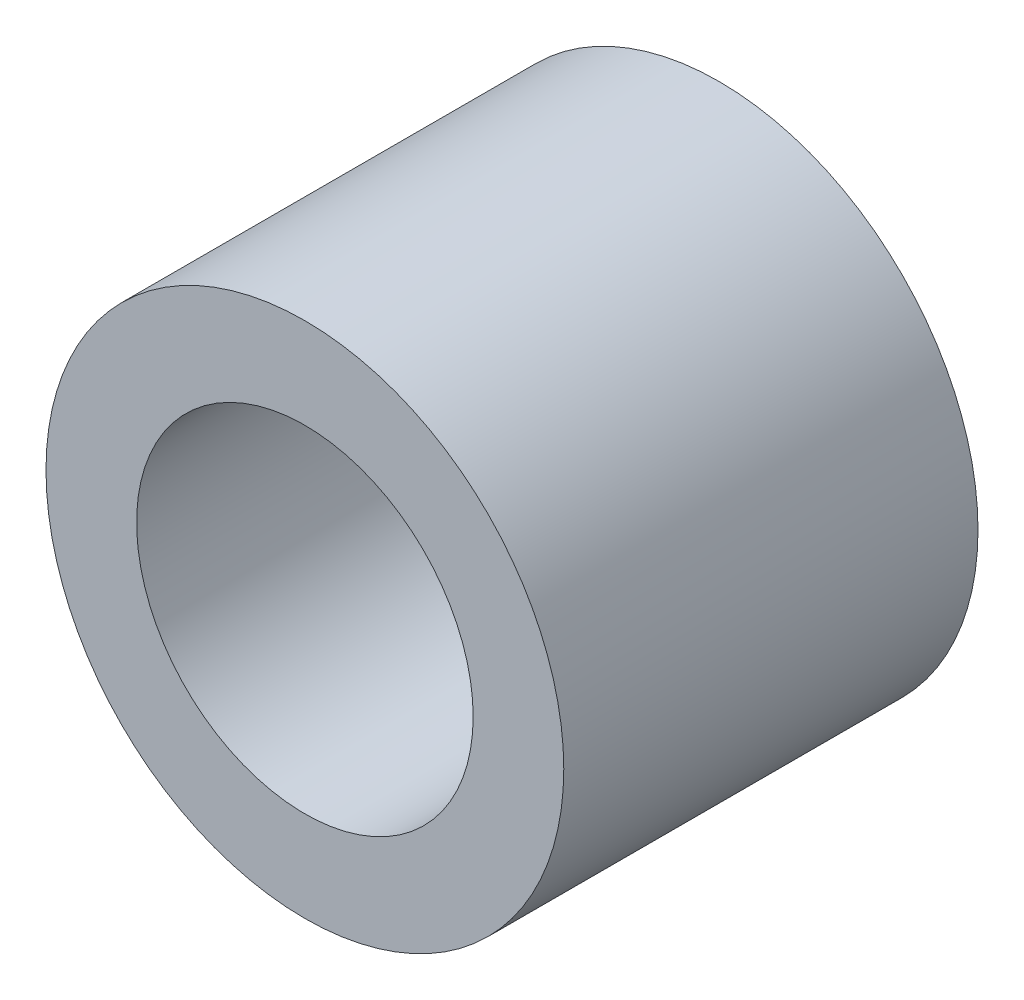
from build123d import *

# Parameters (mm, degrees)
ESQUISSE1_R          = 20
ESQUISSE1_R_2        = 13
BASE_EXTRUSION_DEPTH = 32


with BuildPart() as part:
    # Esquisse1 → Base-Extrusion (new body)
    with BuildSketch(Plane.XY):
        Circle(ESQUISSE1_R)
        Circle(ESQUISSE1_R_2, mode=Mode.SUBTRACT)
    extrude(amount=BASE_EXTRUSION_DEPTH)


solid = part.part
